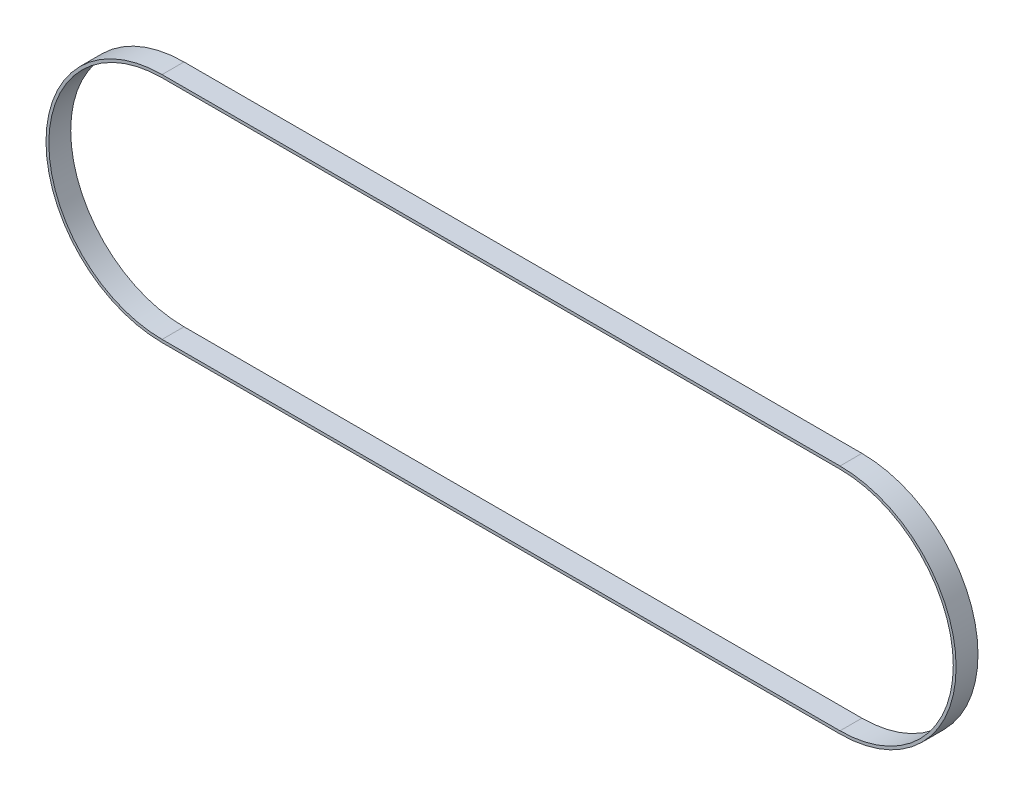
from build123d import *

# Parameters (mm, degrees)
LINEAR_AUSTRAGEN_D_NN1_DEPTH = 3.875


with BuildPart() as part:
    # Skizze2 → Linear-Austragen-D_nn1 (new, symmetric)
    with BuildSketch(Plane.XY):
        with BuildLine():
            Line((240, -41.095), (0, -41.095))
            ThreePointArc((0, -41.095), (-41.095, 0), (0, 41.095))
            Line((0, 41.095), (240, 41.095))
            ThreePointArc((240, 41.095), (281.095, 0), (240, -41.095))
        make_face()
        with BuildLine():
            Line((240, -40.095), (0, -40.095))
            ThreePointArc((0, -40.095), (-40.095, 0), (0, 40.095))
            Line((0, 40.095), (240, 40.095))
            ThreePointArc((240, 40.095), (280.095, 0), (240, -40.095))
        make_face(mode=Mode.SUBTRACT)
    extrude(amount=LINEAR_AUSTRAGEN_D_NN1_DEPTH, both=True)


solid = part.part
